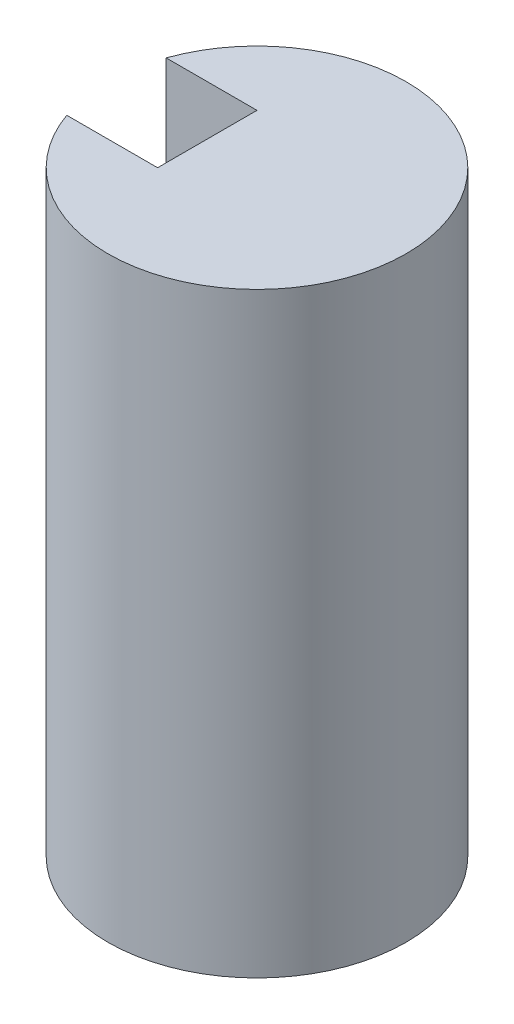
from build123d import *

# Parameters (mm, degrees)
SKETCH3_R           = 1.5
BOSS_EXTRUDE2_DEPTH = 6
SKETCH6_W           = 1
SKETCH6_H           = 3
CUT_EXTRUDE2_DEPTH  = 1


with BuildPart() as part:
    # Sketch3 → Boss-Extrude2 (new body)
    with BuildSketch(Plane(origin=(0, 0, 0), x_dir=(1, 0, 0), z_dir=(0, 1, 0))):
        with Locations(Location((1.5, 0, 0), (0, 0, 90))):
            Circle(SKETCH3_R)
    extrude(amount=BOSS_EXTRUDE2_DEPTH)

    # Sketch6 → Cut-Extrude2 (cut)
    with BuildSketch(Plane(origin=(0, 0, 0), x_dir=(0, 0, -1), z_dir=(1, 0, 0))):
        with Locations((0, 4.5)):
            Rectangle(SKETCH6_W, SKETCH6_H)
    extrude(amount=CUT_EXTRUDE2_DEPTH, mode=Mode.SUBTRACT)


solid = part.part
